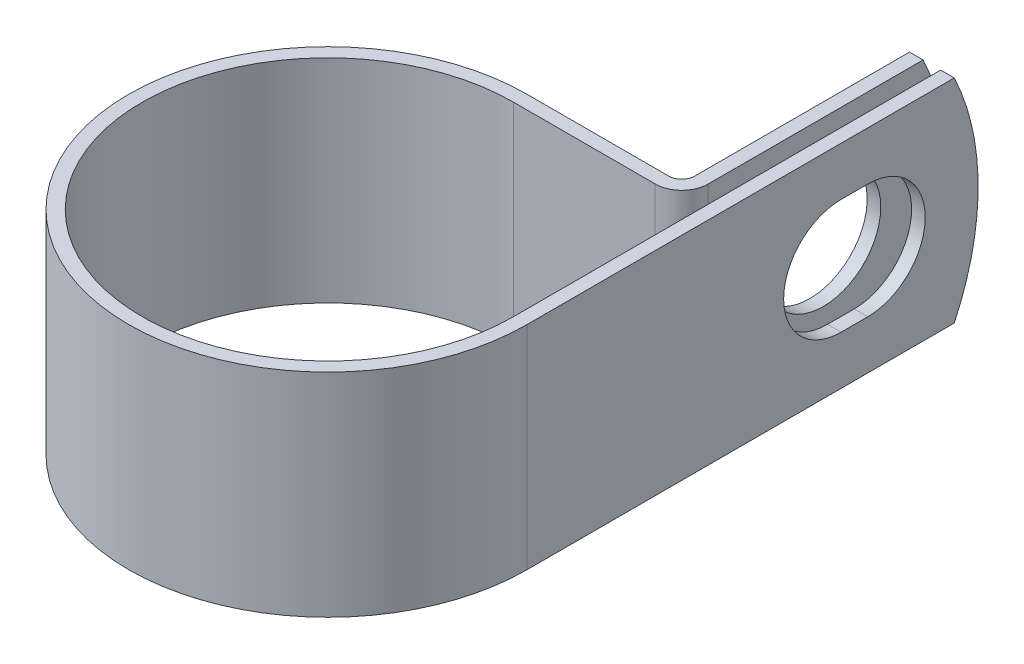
ISO-10303-21;
HEADER;
FILE_DESCRIPTION(('STEP AP214'),'2;1');
FILE_NAME('part.step','',(''),(''),'','','');
FILE_SCHEMA(('AUTOMOTIVE_DESIGN { 1 0 10303 214 1 1 1 1 }'));
ENDSEC;
DATA;
#1=APPLICATION_CONTEXT('core data for automotive mechanical design processes');
#2=APPLICATION_PROTOCOL_DEFINITION('international standard','automotive_design',2000,#1);
#3=PRODUCT_CONTEXT('',#1,'mechanical');
#4=PRODUCT('Part','Part','',(#3));
#5=PRODUCT_RELATED_PRODUCT_CATEGORY('part','',(#4));
#6=PRODUCT_DEFINITION_FORMATION('','',#4);
#7=PRODUCT_DEFINITION_CONTEXT('part definition',#1,'design');
#8=PRODUCT_DEFINITION('design','',#6,#7);
#9=PRODUCT_DEFINITION_SHAPE('','',#8);
#10=(LENGTH_UNIT() NAMED_UNIT(*) SI_UNIT(.MILLI.,.METRE.));
#11=(NAMED_UNIT(*) PLANE_ANGLE_UNIT() SI_UNIT($,.RADIAN.));
#12=(NAMED_UNIT(*) SI_UNIT($,.STERADIAN.) SOLID_ANGLE_UNIT());
#13=UNCERTAINTY_MEASURE_WITH_UNIT(LENGTH_MEASURE(1.E-05),#10,'distance_accuracy_value','');
#14=(GEOMETRIC_REPRESENTATION_CONTEXT(3) GLOBAL_UNCERTAINTY_ASSIGNED_CONTEXT((#13)) GLOBAL_UNIT_ASSIGNED_CONTEXT((#10,
#11,#12)) REPRESENTATION_CONTEXT('',''));
#15=CARTESIAN_POINT('',(0.,0.,0.));
#16=DIRECTION('',(0.,0.,1.));
#17=DIRECTION('',(1.,0.,0.));
#18=AXIS2_PLACEMENT_3D('',#15,#16,#17);
#19=CARTESIAN_POINT('',(16.6624,9.525,0.));
#20=DIRECTION('',(-1.,0.,0.));
#21=DIRECTION('',(0.,0.,1.));
#22=AXIS2_PLACEMENT_3D('',#19,#20,#21);
#23=PLANE('',#22);
#24=DIRECTION('',(0.,0.,-1.));
#25=VECTOR('',#24,1.);
#26=CARTESIAN_POINT('',(16.6624,-5.1562,-28.1685999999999));
#27=LINE('',#26,#25);
#28=CARTESIAN_POINT('',(16.6624,-5.1562,-28.1685999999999));
#29=VERTEX_POINT('',#28);
#30=CARTESIAN_POINT('',(16.6624,-5.1562,-30.5562000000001));
#31=VERTEX_POINT('',#30);
#32=EDGE_CURVE('E236',#29,#31,#27,.T.);
#33=ORIENTED_EDGE('',*,*,#32,.T.);
#34=CARTESIAN_POINT('',(16.6624,0.,-30.5561999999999));
#35=DIRECTION('',(-1.,0.,0.));
#36=DIRECTION('',(0.,0.,1.));
#37=AXIS2_PLACEMENT_3D('',#34,#35,#36);
#38=CIRCLE('',#37,5.1562);
#39=CARTESIAN_POINT('',(16.6624,5.1562,-30.5562000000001));
#40=VERTEX_POINT('',#39);
#41=EDGE_CURVE('E257',#31,#40,#38,.F.);
#42=ORIENTED_EDGE('',*,*,#41,.T.);
#43=DIRECTION('',(0.,0.,1.));
#44=VECTOR('',#43,1.);
#45=CARTESIAN_POINT('',(16.6624,5.1562,-28.1685999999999));
#46=LINE('',#45,#44);
#47=CARTESIAN_POINT('',(16.6624,5.1562,-28.1685999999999));
#48=VERTEX_POINT('',#47);
#49=EDGE_CURVE('E253',#40,#48,#46,.T.);
#50=ORIENTED_EDGE('',*,*,#49,.T.);
#51=CARTESIAN_POINT('',(16.6624,0.,-28.1685999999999));
#52=DIRECTION('',(-1.,0.,0.));
#53=DIRECTION('',(0.,0.,1.));
#54=AXIS2_PLACEMENT_3D('',#51,#52,#53);
#55=CIRCLE('',#54,5.1562);
#56=EDGE_CURVE('E248',#48,#29,#55,.F.);
#57=ORIENTED_EDGE('',*,*,#56,.T.);
#58=EDGE_LOOP('',(#33,#42,#50,#57));
#59=FACE_BOUND('',#58,.T.);
#60=CARTESIAN_POINT('',(16.6624,0.,-18.2372));
#61=DIRECTION('',(-1.,0.,0.));
#62=DIRECTION('',(0.,0.,1.));
#63=AXIS2_PLACEMENT_3D('',#60,#61,#62);
#64=CIRCLE('',#63,22.225);
#65=CARTESIAN_POINT('',(16.6624,9.525,-38.3176631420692));
#66=VERTEX_POINT('',#65);
#67=CARTESIAN_POINT('',(16.6624,-9.525,-38.3176631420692));
#68=VERTEX_POINT('',#67);
#69=EDGE_CURVE('E75',#66,#68,#64,.T.);
#70=ORIENTED_EDGE('',*,*,#69,.T.);
#71=DIRECTION('',(0.,0.,-1.));
#72=VECTOR('',#71,1.);
#73=CARTESIAN_POINT('',(16.6624,-9.525,0.));
#74=LINE('',#73,#72);
#75=CARTESIAN_POINT('',(16.6624,-9.525,0.));
#76=VERTEX_POINT('',#75);
#77=EDGE_CURVE('E271',#76,#68,#74,.T.);
#78=ORIENTED_EDGE('',*,*,#77,.F.);
#79=DIRECTION('',(0.,-1.,0.));
#80=VECTOR('',#79,1.);
#81=CARTESIAN_POINT('',(16.6624,9.525,0.));
#82=LINE('',#81,#80);
#83=CARTESIAN_POINT('',(16.6624,9.525,0.));
#84=VERTEX_POINT('',#83);
#85=EDGE_CURVE('E218',#84,#76,#82,.T.);
#86=ORIENTED_EDGE('',*,*,#85,.F.);
#87=DIRECTION('',(0.,0.,-1.));
#88=VECTOR('',#87,1.);
#89=CARTESIAN_POINT('',(16.6624,9.525,-16.6624));
#90=LINE('',#89,#88);
#91=EDGE_CURVE('E273',#84,#66,#90,.T.);
#92=ORIENTED_EDGE('',*,*,#91,.T.);
#93=EDGE_LOOP('',(#70,#78,#86,#92));
#94=FACE_BOUND('',#93,.T.);
#95=ADVANCED_FACE('F54',(#59,#94),#23,.T.);
#96=CARTESIAN_POINT('',(15.0876,9.525,-40.4622));
#97=DIRECTION('',(1.,0.,0.));
#98=DIRECTION('',(0.,0.,-1.));
#99=AXIS2_PLACEMENT_3D('',#96,#97,#98);
#100=PLANE('',#99);
#101=CARTESIAN_POINT('',(15.0876,0.,-29.3624));
#102=DIRECTION('',(1.,0.,0.));
#103=DIRECTION('',(0.,0.,-1.));
#104=AXIS2_PLACEMENT_3D('',#101,#102,#103);
#105=CIRCLE('',#104,5.1562);
#106=CARTESIAN_POINT('',(15.0876,0.,-34.5186));
#107=VERTEX_POINT('',#106);
#108=EDGE_CURVE('E268',#107,#107,#105,.F.);
#109=ORIENTED_EDGE('',*,*,#108,.T.);
#110=EDGE_LOOP('',(#109));
#111=FACE_BOUND('',#110,.T.);
#112=DIRECTION('',(0.,0.,1.));
#113=VECTOR('',#112,1.);
#114=CARTESIAN_POINT('',(15.0876,-9.525,-40.4622));
#115=LINE('',#114,#113);
#116=CARTESIAN_POINT('',(15.0876,-9.525,-38.3176631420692));
#117=VERTEX_POINT('',#116);
#118=CARTESIAN_POINT('',(15.0876,-9.525,-19.03984));
#119=VERTEX_POINT('',#118);
#120=EDGE_CURVE('E184',#117,#119,#115,.T.);
#121=ORIENTED_EDGE('',*,*,#120,.F.);
#122=CARTESIAN_POINT('',(15.0876,0.,-18.2372));
#123=DIRECTION('',(1.,0.,0.));
#124=DIRECTION('',(0.,0.,-1.));
#125=AXIS2_PLACEMENT_3D('',#122,#123,#124);
#126=CIRCLE('',#125,22.225);
#127=CARTESIAN_POINT('',(15.0876,9.525,-38.3176631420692));
#128=VERTEX_POINT('',#127);
#129=EDGE_CURVE('E176',#117,#128,#126,.T.);
#130=ORIENTED_EDGE('',*,*,#129,.T.);
#131=DIRECTION('',(0.,0.,1.));
#132=VECTOR('',#131,1.);
#133=CARTESIAN_POINT('',(15.0876,9.525,-40.4622));
#134=LINE('',#133,#132);
#135=CARTESIAN_POINT('',(15.0876,9.525,-19.03984));
#136=VERTEX_POINT('',#135);
#137=EDGE_CURVE('E224',#128,#136,#134,.T.);
#138=ORIENTED_EDGE('',*,*,#137,.T.);
#139=DIRECTION('',(0.,-1.,0.));
#140=VECTOR('',#139,1.);
#141=CARTESIAN_POINT('',(15.0876,9.525,-19.03984));
#142=LINE('',#141,#140);
#143=EDGE_CURVE('E211',#136,#119,#142,.T.);
#144=ORIENTED_EDGE('',*,*,#143,.T.);
#145=EDGE_LOOP('',(#121,#130,#138,#144));
#146=FACE_BOUND('',#145,.T.);
#147=ADVANCED_FACE('F226',(#111,#146),#100,.T.);
#148=CARTESIAN_POINT('',(13.8684,9.525,-40.4622));
#149=DIRECTION('',(1.,0.,0.));
#150=DIRECTION('',(0.,0.,-1.));
#151=AXIS2_PLACEMENT_3D('',#148,#149,#150);
#152=PLANE('',#151);
#153=CARTESIAN_POINT('',(13.8684,0.,-29.3624));
#154=DIRECTION('',(-1.,0.,0.));
#155=DIRECTION('',(0.,0.,1.));
#156=AXIS2_PLACEMENT_3D('',#153,#154,#155);
#157=CIRCLE('',#156,5.1562);
#158=CARTESIAN_POINT('',(13.8684,0.,-24.2062));
#159=VERTEX_POINT('',#158);
#160=EDGE_CURVE('E265',#159,#159,#157,.T.);
#161=ORIENTED_EDGE('',*,*,#160,.F.);
#162=EDGE_LOOP('',(#161));
#163=FACE_BOUND('',#162,.T.);
#164=CARTESIAN_POINT('',(13.8684,0.,-18.2372));
#165=DIRECTION('',(-1.,0.,0.));
#166=DIRECTION('',(0.,0.,1.));
#167=AXIS2_PLACEMENT_3D('',#164,#165,#166);
#168=CIRCLE('',#167,22.225);
#169=CARTESIAN_POINT('',(13.8684,9.525,-38.3176631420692));
#170=VERTEX_POINT('',#169);
#171=CARTESIAN_POINT('',(13.8684,-9.525,-38.3176631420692));
#172=VERTEX_POINT('',#171);
#173=EDGE_CURVE('E67',#170,#172,#168,.T.);
#174=ORIENTED_EDGE('',*,*,#173,.T.);
#175=DIRECTION('',(0.,0.,1.));
#176=VECTOR('',#175,1.);
#177=CARTESIAN_POINT('',(13.8684,-9.525,-40.4622));
#178=LINE('',#177,#176);
#179=CARTESIAN_POINT('',(13.8684,-9.525,-19.03984));
#180=VERTEX_POINT('',#179);
#181=EDGE_CURVE('E167',#172,#180,#178,.T.);
#182=ORIENTED_EDGE('',*,*,#181,.T.);
#183=DIRECTION('',(0.,-1.,0.));
#184=VECTOR('',#183,1.);
#185=CARTESIAN_POINT('',(13.8684,9.525,-19.03984));
#186=LINE('',#185,#184);
#187=CARTESIAN_POINT('',(13.8684,9.525,-19.03984));
#188=VERTEX_POINT('',#187);
#189=EDGE_CURVE('E209',#188,#180,#186,.T.);
#190=ORIENTED_EDGE('',*,*,#189,.F.);
#191=DIRECTION('',(0.,0.,1.));
#192=VECTOR('',#191,1.);
#193=CARTESIAN_POINT('',(13.8684,9.525,-40.4622));
#194=LINE('',#193,#192);
#195=EDGE_CURVE('E169',#170,#188,#194,.T.);
#196=ORIENTED_EDGE('',*,*,#195,.F.);
#197=EDGE_LOOP('',(#174,#182,#190,#196));
#198=FACE_BOUND('',#197,.T.);
#199=ADVANCED_FACE('F164',(#163,#198),#152,.F.);
#200=CARTESIAN_POINT('',(17.8816,9.525,0.));
#201=DIRECTION('',(-1.,0.,0.));
#202=DIRECTION('',(0.,0.,1.));
#203=AXIS2_PLACEMENT_3D('',#200,#201,#202);
#204=PLANE('',#203);
#205=CARTESIAN_POINT('',(17.8816,0.,-30.5561999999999));
#206=DIRECTION('',(1.,0.,0.));
#207=DIRECTION('',(0.,0.,-1.));
#208=AXIS2_PLACEMENT_3D('',#205,#206,#207);
#209=CIRCLE('',#208,5.1562);
#210=CARTESIAN_POINT('',(17.8816,-5.1562,-30.5562000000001));
#211=VERTEX_POINT('',#210);
#212=CARTESIAN_POINT('',(17.8816,5.1562,-30.5562000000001));
#213=VERTEX_POINT('',#212);
#214=EDGE_CURVE('E237',#211,#213,#209,.T.);
#215=ORIENTED_EDGE('',*,*,#214,.F.);
#216=DIRECTION('',(0.,0.,-1.));
#217=VECTOR('',#216,1.);
#218=CARTESIAN_POINT('',(17.8816,-5.1562,-28.1685999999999));
#219=LINE('',#218,#217);
#220=CARTESIAN_POINT('',(17.8816,-5.1562,-28.1685999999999));
#221=VERTEX_POINT('',#220);
#222=EDGE_CURVE('E240',#221,#211,#219,.T.);
#223=ORIENTED_EDGE('',*,*,#222,.F.);
#224=CARTESIAN_POINT('',(17.8816,0.,-28.1685999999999));
#225=DIRECTION('',(1.,0.,0.));
#226=DIRECTION('',(0.,0.,-1.));
#227=AXIS2_PLACEMENT_3D('',#224,#225,#226);
#228=CIRCLE('',#227,5.1562);
#229=CARTESIAN_POINT('',(17.8816,5.1562,-28.1685999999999));
#230=VERTEX_POINT('',#229);
#231=EDGE_CURVE('E230',#230,#221,#228,.T.);
#232=ORIENTED_EDGE('',*,*,#231,.F.);
#233=DIRECTION('',(0.,0.,1.));
#234=VECTOR('',#233,1.);
#235=CARTESIAN_POINT('',(17.8816,5.1562,-28.1685999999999));
#236=LINE('',#235,#234);
#237=EDGE_CURVE('E234',#213,#230,#236,.T.);
#238=ORIENTED_EDGE('',*,*,#237,.F.);
#239=EDGE_LOOP('',(#215,#223,#232,#238));
#240=FACE_BOUND('',#239,.T.);
#241=DIRECTION('',(0.,0.,-1.));
#242=VECTOR('',#241,1.);
#243=CARTESIAN_POINT('',(17.8816,-9.525,0.));
#244=LINE('',#243,#242);
#245=CARTESIAN_POINT('',(17.8816,-9.525,0.));
#246=VERTEX_POINT('',#245);
#247=CARTESIAN_POINT('',(17.8816,-9.525,-38.3176631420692));
#248=VERTEX_POINT('',#247);
#249=EDGE_CURVE('E195',#246,#248,#244,.T.);
#250=ORIENTED_EDGE('',*,*,#249,.T.);
#251=CARTESIAN_POINT('',(17.8816,0.,-18.2372));
#252=DIRECTION('',(-1.,0.,0.));
#253=DIRECTION('',(0.,0.,1.));
#254=AXIS2_PLACEMENT_3D('',#251,#252,#253);
#255=CIRCLE('',#254,22.225);
#256=CARTESIAN_POINT('',(17.8816,9.525,-38.3176631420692));
#257=VERTEX_POINT('',#256);
#258=EDGE_CURVE('E170',#257,#248,#255,.T.);
#259=ORIENTED_EDGE('',*,*,#258,.F.);
#260=DIRECTION('',(0.,0.,-1.));
#261=VECTOR('',#260,1.);
#262=CARTESIAN_POINT('',(17.8816,9.525,-16.6624));
#263=LINE('',#262,#261);
#264=CARTESIAN_POINT('',(17.8816,9.525,0.));
#265=VERTEX_POINT('',#264);
#266=EDGE_CURVE('E198',#265,#257,#263,.T.);
#267=ORIENTED_EDGE('',*,*,#266,.F.);
#268=DIRECTION('',(0.,-1.,0.));
#269=VECTOR('',#268,1.);
#270=CARTESIAN_POINT('',(17.8816,9.525,0.));
#271=LINE('',#270,#269);
#272=EDGE_CURVE('E199',#265,#246,#271,.T.);
#273=ORIENTED_EDGE('',*,*,#272,.T.);
#274=EDGE_LOOP('',(#250,#259,#267,#273));
#275=FACE_BOUND('',#274,.T.);
#276=ADVANCED_FACE('F321',(#240,#275),#204,.F.);
#277=CARTESIAN_POINT('',(0.,-9.525,0.));
#278=DIRECTION('',(0.,1.,0.));
#279=DIRECTION('',(1.,0.,0.));
#280=AXIS2_PLACEMENT_3D('',#277,#278,#279);
#281=PLANE('',#280);
#282=DIRECTION('',(-1.,0.,0.));
#283=VECTOR('',#282,1.);
#284=CARTESIAN_POINT('',(17.8816,-9.525,-38.3176631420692));
#285=LINE('',#284,#283);
#286=EDGE_CURVE('E171',#248,#68,#285,.T.);
#287=ORIENTED_EDGE('',*,*,#286,.F.);
#288=ORIENTED_EDGE('',*,*,#249,.F.);
#289=CARTESIAN_POINT('',(0.,-9.525,0.));
#290=DIRECTION('',(0.,1.,0.));
#291=DIRECTION('',(1.,0.,0.));
#292=AXIS2_PLACEMENT_3D('',#289,#290,#291);
#293=CIRCLE('',#292,17.8816);
#294=CARTESIAN_POINT('',(0.,-9.525,-17.8816));
#295=VERTEX_POINT('',#294);
#296=EDGE_CURVE('E193',#295,#246,#293,.T.);
#297=ORIENTED_EDGE('',*,*,#296,.F.);
#298=DIRECTION('',(1.,0.,0.));
#299=VECTOR('',#298,1.);
#300=CARTESIAN_POINT('',(0.,-9.525,-17.8816));
#301=LINE('',#300,#299);
#302=CARTESIAN_POINT('',(12.71016,-9.525,-17.8816));
#303=VERTEX_POINT('',#302);
#304=EDGE_CURVE('E186',#303,#295,#301,.F.);
#305=ORIENTED_EDGE('',*,*,#304,.F.);
#306=CARTESIAN_POINT('',(12.71016,-9.525,-19.03984));
#307=DIRECTION('',(0.,1.,0.));
#308=DIRECTION('',(1.,0.,0.));
#309=AXIS2_PLACEMENT_3D('',#306,#307,#308);
#310=CIRCLE('',#309,1.15824);
#311=EDGE_CURVE('E183',#180,#303,#310,.F.);
#312=ORIENTED_EDGE('',*,*,#311,.F.);
#313=ORIENTED_EDGE('',*,*,#181,.F.);
#314=DIRECTION('',(-1.,0.,0.));
#315=VECTOR('',#314,1.);
#316=CARTESIAN_POINT('',(17.8816,-9.525,-38.3176631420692));
#317=LINE('',#316,#315);
#318=EDGE_CURVE('E12',#117,#172,#317,.T.);
#319=ORIENTED_EDGE('',*,*,#318,.F.);
#320=ORIENTED_EDGE('',*,*,#120,.T.);
#321=CARTESIAN_POINT('',(12.71016,-9.525,-19.03984));
#322=DIRECTION('',(0.,-1.,0.));
#323=DIRECTION('',(0.,0.,1.));
#324=AXIS2_PLACEMENT_3D('',#321,#322,#323);
#325=CIRCLE('',#324,2.37744);
#326=CARTESIAN_POINT('',(12.71016,-9.525,-16.6624));
#327=VERTEX_POINT('',#326);
#328=EDGE_CURVE('E188',#119,#327,#325,.T.);
#329=ORIENTED_EDGE('',*,*,#328,.T.);
#330=DIRECTION('',(-1.,0.,0.));
#331=VECTOR('',#330,1.);
#332=CARTESIAN_POINT('',(0.,-9.525,-16.6624));
#333=LINE('',#332,#331);
#334=CARTESIAN_POINT('',(0.,-9.525,-16.6624));
#335=VERTEX_POINT('',#334);
#336=EDGE_CURVE('E298',#327,#335,#333,.T.);
#337=ORIENTED_EDGE('',*,*,#336,.T.);
#338=CARTESIAN_POINT('',(0.,-9.525,0.));
#339=DIRECTION('',(0.,1.,0.));
#340=DIRECTION('',(0.,0.,1.));
#341=AXIS2_PLACEMENT_3D('',#338,#339,#340);
#342=CIRCLE('',#341,16.6624);
#343=EDGE_CURVE('E295',#335,#76,#342,.T.);
#344=ORIENTED_EDGE('',*,*,#343,.T.);
#345=ORIENTED_EDGE('',*,*,#77,.T.);
#346=EDGE_LOOP('',(#287,#288,#297,#305,#312,#313,#319,#320,#329,#337,#344,#345));
#347=FACE_BOUND('',#346,.T.);
#348=ADVANCED_FACE('F181',(#347),#281,.F.);
#349=CARTESIAN_POINT('',(0.,9.525,0.));
#350=DIRECTION('',(0.,1.,0.));
#351=DIRECTION('',(1.,0.,0.));
#352=AXIS2_PLACEMENT_3D('',#349,#350,#351);
#353=PLANE('',#352);
#354=ORIENTED_EDGE('',*,*,#266,.T.);
#355=DIRECTION('',(-1.,0.,0.));
#356=VECTOR('',#355,1.);
#357=CARTESIAN_POINT('',(17.8816,9.525,-38.3176631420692));
#358=LINE('',#357,#356);
#359=EDGE_CURVE('E228',#257,#66,#358,.T.);
#360=ORIENTED_EDGE('',*,*,#359,.T.);
#361=ORIENTED_EDGE('',*,*,#91,.F.);
#362=CARTESIAN_POINT('',(0.,9.525,0.));
#363=DIRECTION('',(0.,1.,0.));
#364=DIRECTION('',(0.,0.,1.));
#365=AXIS2_PLACEMENT_3D('',#362,#363,#364);
#366=CIRCLE('',#365,16.6624);
#367=CARTESIAN_POINT('',(0.,9.525,-16.6624));
#368=VERTEX_POINT('',#367);
#369=EDGE_CURVE('E276',#368,#84,#366,.T.);
#370=ORIENTED_EDGE('',*,*,#369,.F.);
#371=DIRECTION('',(-1.,0.,0.));
#372=VECTOR('',#371,1.);
#373=CARTESIAN_POINT('',(0.,9.525,-16.6624));
#374=LINE('',#373,#372);
#375=CARTESIAN_POINT('',(12.71016,9.525,-16.6624));
#376=VERTEX_POINT('',#375);
#377=EDGE_CURVE('E279',#376,#368,#374,.T.);
#378=ORIENTED_EDGE('',*,*,#377,.F.);
#379=CARTESIAN_POINT('',(12.71016,9.525,-19.03984));
#380=DIRECTION('',(0.,-1.,0.));
#381=DIRECTION('',(0.,0.,1.));
#382=AXIS2_PLACEMENT_3D('',#379,#380,#381);
#383=CIRCLE('',#382,2.37744);
#384=EDGE_CURVE('E282',#136,#376,#383,.T.);
#385=ORIENTED_EDGE('',*,*,#384,.F.);
#386=ORIENTED_EDGE('',*,*,#137,.F.);
#387=DIRECTION('',(-1.,0.,0.));
#388=VECTOR('',#387,1.);
#389=CARTESIAN_POINT('',(17.8816,9.525,-38.3176631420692));
#390=LINE('',#389,#388);
#391=EDGE_CURVE('E61',#128,#170,#390,.T.);
#392=ORIENTED_EDGE('',*,*,#391,.T.);
#393=ORIENTED_EDGE('',*,*,#195,.T.);
#394=CARTESIAN_POINT('',(12.71016,9.525,-19.03984));
#395=DIRECTION('',(0.,1.,0.));
#396=DIRECTION('',(1.,0.,0.));
#397=AXIS2_PLACEMENT_3D('',#394,#395,#396);
#398=CIRCLE('',#397,1.15824);
#399=CARTESIAN_POINT('',(12.71016,9.525,-17.8816));
#400=VERTEX_POINT('',#399);
#401=EDGE_CURVE('E287',#188,#400,#398,.F.);
#402=ORIENTED_EDGE('',*,*,#401,.T.);
#403=DIRECTION('',(1.,0.,0.));
#404=VECTOR('',#403,1.);
#405=CARTESIAN_POINT('',(0.,9.525,-17.8816));
#406=LINE('',#405,#404);
#407=CARTESIAN_POINT('',(0.,9.525,-17.8816));
#408=VERTEX_POINT('',#407);
#409=EDGE_CURVE('E289',#400,#408,#406,.F.);
#410=ORIENTED_EDGE('',*,*,#409,.T.);
#411=CARTESIAN_POINT('',(0.,9.525,0.));
#412=DIRECTION('',(0.,1.,0.));
#413=DIRECTION('',(1.,0.,0.));
#414=AXIS2_PLACEMENT_3D('',#411,#412,#413);
#415=CIRCLE('',#414,17.8816);
#416=EDGE_CURVE('E203',#408,#265,#415,.T.);
#417=ORIENTED_EDGE('',*,*,#416,.T.);
#418=EDGE_LOOP('',(#354,#360,#361,#370,#378,#385,#386,#392,#393,#402,#410,#417));
#419=FACE_BOUND('',#418,.T.);
#420=ADVANCED_FACE('F222',(#419),#353,.T.);
#421=CARTESIAN_POINT('',(0.,9.525,0.));
#422=DIRECTION('',(0.,-1.,0.));
#423=DIRECTION('',(0.,0.,-1.));
#424=AXIS2_PLACEMENT_3D('',#421,#422,#423);
#425=CYLINDRICAL_SURFACE('',#424,16.6624);
#426=ORIENTED_EDGE('',*,*,#343,.F.);
#427=DIRECTION('',(0.,-1.,0.));
#428=VECTOR('',#427,1.);
#429=CARTESIAN_POINT('',(0.,9.525,-16.6624));
#430=LINE('',#429,#428);
#431=EDGE_CURVE('E216',#368,#335,#430,.T.);
#432=ORIENTED_EDGE('',*,*,#431,.F.);
#433=ORIENTED_EDGE('',*,*,#369,.T.);
#434=ORIENTED_EDGE('',*,*,#85,.T.);
#435=EDGE_LOOP('',(#426,#432,#433,#434));
#436=FACE_BOUND('',#435,.T.);
#437=ADVANCED_FACE('F311',(#436),#425,.F.);
#438=CARTESIAN_POINT('',(0.,9.525,-16.6624));
#439=DIRECTION('',(0.,0.,1.));
#440=DIRECTION('',(1.,0.,0.));
#441=AXIS2_PLACEMENT_3D('',#438,#439,#440);
#442=PLANE('',#441);
#443=ORIENTED_EDGE('',*,*,#336,.F.);
#444=DIRECTION('',(0.,-1.,0.));
#445=VECTOR('',#444,1.);
#446=CARTESIAN_POINT('',(12.71016,9.525,-16.6624));
#447=LINE('',#446,#445);
#448=EDGE_CURVE('E214',#376,#327,#447,.T.);
#449=ORIENTED_EDGE('',*,*,#448,.F.);
#450=ORIENTED_EDGE('',*,*,#377,.T.);
#451=ORIENTED_EDGE('',*,*,#431,.T.);
#452=EDGE_LOOP('',(#443,#449,#450,#451));
#453=FACE_BOUND('',#452,.T.);
#454=ADVANCED_FACE('F307',(#453),#442,.T.);
#455=CARTESIAN_POINT('',(12.71016,9.525,-19.03984));
#456=DIRECTION('',(0.,-1.,0.));
#457=DIRECTION('',(0.,0.,-1.));
#458=AXIS2_PLACEMENT_3D('',#455,#456,#457);
#459=CYLINDRICAL_SURFACE('',#458,2.37744);
#460=ORIENTED_EDGE('',*,*,#328,.F.);
#461=ORIENTED_EDGE('',*,*,#143,.F.);
#462=ORIENTED_EDGE('',*,*,#384,.T.);
#463=ORIENTED_EDGE('',*,*,#448,.T.);
#464=EDGE_LOOP('',(#460,#461,#462,#463));
#465=FACE_BOUND('',#464,.T.);
#466=ADVANCED_FACE('F304',(#465),#459,.T.);
#467=CARTESIAN_POINT('',(12.71016,9.525,-19.03984));
#468=DIRECTION('',(0.,-1.,0.));
#469=DIRECTION('',(0.,0.,-1.));
#470=AXIS2_PLACEMENT_3D('',#467,#468,#469);
#471=CYLINDRICAL_SURFACE('',#470,1.15824);
#472=ORIENTED_EDGE('',*,*,#311,.T.);
#473=DIRECTION('',(0.,-1.,0.));
#474=VECTOR('',#473,1.);
#475=CARTESIAN_POINT('',(12.71016,9.525,-17.8816));
#476=LINE('',#475,#474);
#477=EDGE_CURVE('E206',#400,#303,#476,.T.);
#478=ORIENTED_EDGE('',*,*,#477,.F.);
#479=ORIENTED_EDGE('',*,*,#401,.F.);
#480=ORIENTED_EDGE('',*,*,#189,.T.);
#481=EDGE_LOOP('',(#472,#478,#479,#480));
#482=FACE_BOUND('',#481,.T.);
#483=ADVANCED_FACE('F334',(#482),#471,.F.);
#484=CARTESIAN_POINT('',(0.,9.525,-17.8816));
#485=DIRECTION('',(0.,0.,1.));
#486=DIRECTION('',(1.,0.,0.));
#487=AXIS2_PLACEMENT_3D('',#484,#485,#486);
#488=PLANE('',#487);
#489=ORIENTED_EDGE('',*,*,#304,.T.);
#490=DIRECTION('',(0.,-1.,0.));
#491=VECTOR('',#490,1.);
#492=CARTESIAN_POINT('',(0.,9.525,-17.8816));
#493=LINE('',#492,#491);
#494=EDGE_CURVE('E202',#408,#295,#493,.T.);
#495=ORIENTED_EDGE('',*,*,#494,.F.);
#496=ORIENTED_EDGE('',*,*,#409,.F.);
#497=ORIENTED_EDGE('',*,*,#477,.T.);
#498=EDGE_LOOP('',(#489,#495,#496,#497));
#499=FACE_BOUND('',#498,.T.);
#500=ADVANCED_FACE('F330',(#499),#488,.F.);
#501=CARTESIAN_POINT('',(0.,9.525,0.));
#502=DIRECTION('',(0.,-1.,0.));
#503=DIRECTION('',(0.,0.,-1.));
#504=AXIS2_PLACEMENT_3D('',#501,#502,#503);
#505=CYLINDRICAL_SURFACE('',#504,17.8816);
#506=ORIENTED_EDGE('',*,*,#296,.T.);
#507=ORIENTED_EDGE('',*,*,#272,.F.);
#508=ORIENTED_EDGE('',*,*,#416,.F.);
#509=ORIENTED_EDGE('',*,*,#494,.T.);
#510=EDGE_LOOP('',(#506,#507,#508,#509));
#511=FACE_BOUND('',#510,.T.);
#512=ADVANCED_FACE('F327',(#511),#505,.T.);
#513=CARTESIAN_POINT('',(29.6715359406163,0.,-29.3624));
#514=DIRECTION('',(-1.,0.,0.));
#515=DIRECTION('',(0.,0.,1.));
#516=AXIS2_PLACEMENT_3D('',#513,#514,#515);
#517=CYLINDRICAL_SURFACE('',#516,5.1562);
#518=ORIENTED_EDGE('',*,*,#160,.T.);
#519=EDGE_LOOP('',(#518));
#520=FACE_BOUND('',#519,.T.);
#521=ORIENTED_EDGE('',*,*,#108,.F.);
#522=EDGE_LOOP('',(#521));
#523=FACE_BOUND('',#522,.T.);
#524=ADVANCED_FACE('F379',(#520,#523),#517,.F.);
#525=CARTESIAN_POINT('',(0.302828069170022,-5.1562,-28.1685999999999));
#526=DIRECTION('',(0.,-1.,0.));
#527=DIRECTION('',(0.,0.,-1.));
#528=AXIS2_PLACEMENT_3D('',#525,#526,#527);
#529=PLANE('',#528);
#530=DIRECTION('',(1.,0.,0.));
#531=VECTOR('',#530,1.);
#532=CARTESIAN_POINT('',(0.302828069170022,-5.1562,-28.1685999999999));
#533=LINE('',#532,#531);
#534=EDGE_CURVE('E251',#29,#221,#533,.T.);
#535=ORIENTED_EDGE('',*,*,#534,.T.);
#536=ORIENTED_EDGE('',*,*,#222,.T.);
#537=DIRECTION('',(1.,0.,0.));
#538=VECTOR('',#537,1.);
#539=CARTESIAN_POINT('',(0.302828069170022,-5.1562,-30.5562000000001));
#540=LINE('',#539,#538);
#541=EDGE_CURVE('E247',#31,#211,#540,.T.);
#542=ORIENTED_EDGE('',*,*,#541,.F.);
#543=ORIENTED_EDGE('',*,*,#32,.F.);
#544=EDGE_LOOP('',(#535,#536,#542,#543));
#545=FACE_BOUND('',#544,.T.);
#546=ADVANCED_FACE('F354',(#545),#529,.F.);
#547=CARTESIAN_POINT('',(0.302828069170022,0.,-30.5561999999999));
#548=DIRECTION('',(1.,0.,0.));
#549=DIRECTION('',(0.,0.,-1.));
#550=AXIS2_PLACEMENT_3D('',#547,#548,#549);
#551=CYLINDRICAL_SURFACE('',#550,5.1562);
#552=ORIENTED_EDGE('',*,*,#541,.T.);
#553=ORIENTED_EDGE('',*,*,#214,.T.);
#554=DIRECTION('',(1.,0.,0.));
#555=VECTOR('',#554,1.);
#556=CARTESIAN_POINT('',(0.302828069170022,5.1562,-30.5562000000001));
#557=LINE('',#556,#555);
#558=EDGE_CURVE('E256',#40,#213,#557,.T.);
#559=ORIENTED_EDGE('',*,*,#558,.F.);
#560=ORIENTED_EDGE('',*,*,#41,.F.);
#561=EDGE_LOOP('',(#552,#553,#559,#560));
#562=FACE_BOUND('',#561,.T.);
#563=ADVANCED_FACE('F358',(#562),#551,.F.);
#564=CARTESIAN_POINT('',(0.302828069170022,5.1562,-28.1685999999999));
#565=DIRECTION('',(0.,1.,0.));
#566=DIRECTION('',(0.,0.,1.));
#567=AXIS2_PLACEMENT_3D('',#564,#565,#566);
#568=PLANE('',#567);
#569=ORIENTED_EDGE('',*,*,#558,.T.);
#570=ORIENTED_EDGE('',*,*,#237,.T.);
#571=DIRECTION('',(1.,0.,0.));
#572=VECTOR('',#571,1.);
#573=CARTESIAN_POINT('',(0.302828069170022,5.1562,-28.1685999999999));
#574=LINE('',#573,#572);
#575=EDGE_CURVE('E252',#48,#230,#574,.T.);
#576=ORIENTED_EDGE('',*,*,#575,.F.);
#577=ORIENTED_EDGE('',*,*,#49,.F.);
#578=EDGE_LOOP('',(#569,#570,#576,#577));
#579=FACE_BOUND('',#578,.T.);
#580=ADVANCED_FACE('F362',(#579),#568,.F.);
#581=CARTESIAN_POINT('',(0.302828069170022,0.,-28.1685999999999));
#582=DIRECTION('',(1.,0.,0.));
#583=DIRECTION('',(0.,0.,-1.));
#584=AXIS2_PLACEMENT_3D('',#581,#582,#583);
#585=CYLINDRICAL_SURFACE('',#584,5.1562);
#586=ORIENTED_EDGE('',*,*,#575,.T.);
#587=ORIENTED_EDGE('',*,*,#231,.T.);
#588=ORIENTED_EDGE('',*,*,#534,.F.);
#589=ORIENTED_EDGE('',*,*,#56,.F.);
#590=EDGE_LOOP('',(#586,#587,#588,#589));
#591=FACE_BOUND('',#590,.T.);
#592=ADVANCED_FACE('F366',(#591),#585,.F.);
#593=CARTESIAN_POINT('',(17.8816,0.,-18.2372));
#594=DIRECTION('',(-1.,0.,0.));
#595=DIRECTION('',(0.,0.,1.));
#596=AXIS2_PLACEMENT_3D('',#593,#594,#595);
#597=CYLINDRICAL_SURFACE('',#596,22.225);
#598=ORIENTED_EDGE('',*,*,#129,.F.);
#599=ORIENTED_EDGE('',*,*,#318,.T.);
#600=ORIENTED_EDGE('',*,*,#173,.F.);
#601=ORIENTED_EDGE('',*,*,#391,.F.);
#602=EDGE_LOOP('',(#598,#599,#600,#601));
#603=FACE_BOUND('',#602,.T.);
#604=ADVANCED_FACE('F174',(#603),#597,.T.);
#605=ORIENTED_EDGE('',*,*,#359,.F.);
#606=ORIENTED_EDGE('',*,*,#258,.T.);
#607=ORIENTED_EDGE('',*,*,#286,.T.);
#608=ORIENTED_EDGE('',*,*,#69,.F.);
#609=EDGE_LOOP('',(#605,#606,#607,#608));
#610=FACE_BOUND('',#609,.T.);
#611=ADVANCED_FACE('F316',(#610),#597,.T.);
#612=CLOSED_SHELL('',(#95,#147,#199,#276,#348,#420,#437,#454,#466,#483,#500,#512,#524,#546,#563,
#580,#592,#604,#611));
#613=MANIFOLD_SOLID_BREP('B2',#612);
#614=ADVANCED_BREP_SHAPE_REPRESENTATION('',(#18,#613),#14);
#615=SHAPE_DEFINITION_REPRESENTATION(#9,#614);
ENDSEC;
END-ISO-10303-21;
